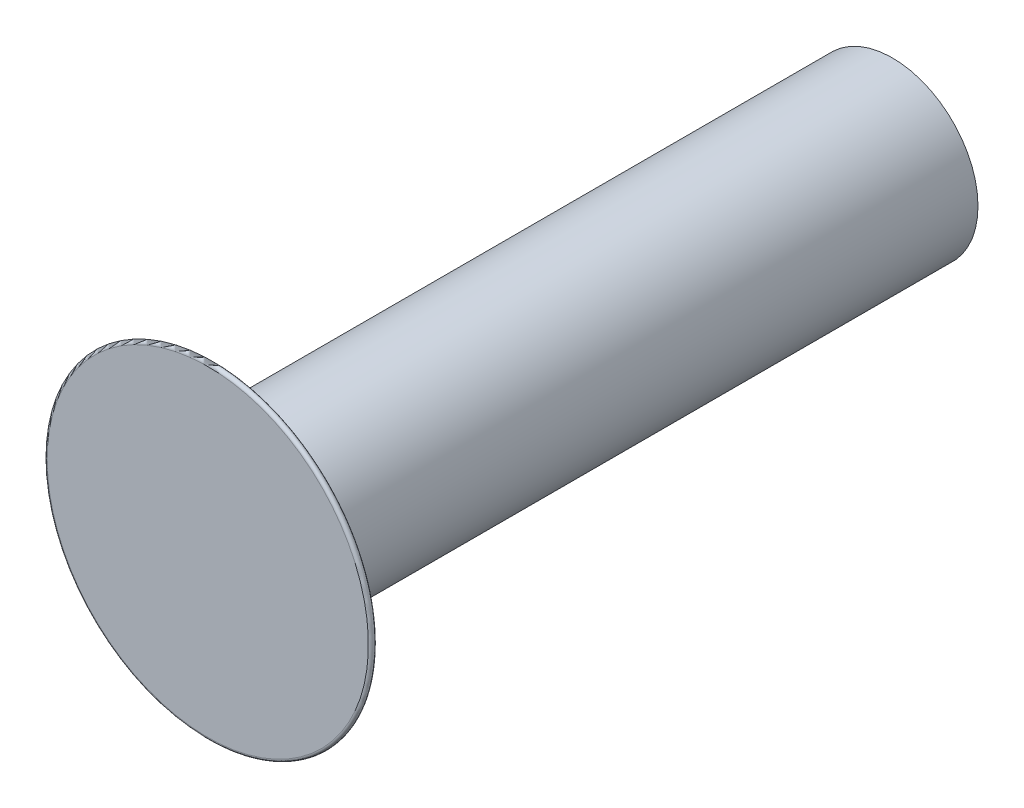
from build123d import *

# Parameters (mm, degrees)
FILLET_2_R = 0.105833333


with BuildPart() as part:
    # BaseBodySke → BaseBody (revolve)
    with BuildSketch(Plane(origin=(0, 0, 0), x_dir=(1, 0, 0), z_dir=(0, 1, 0)), mode=Mode.PRIVATE) as basebody_sk:
        Polygon((0, 0), (-6.35, 0), (-3.175, 1.8542), (-3.175, 25.4), (0, 25.4), align=None)
    revolve(basebody_sk.sketch.rotate(Axis((0, 0, 0), (0, 0, -1)), 180), axis=Axis((0, 0, 0), (0, 0, -1)))

    # Fillet 2
    fillet_2_edges = [part.edges().sort_by_distance(p)[0] for p in [
        (-6.35, 0, 0),
    ]]
    fillet(fillet_2_edges, radius=FILLET_2_R)


solid = part.part
